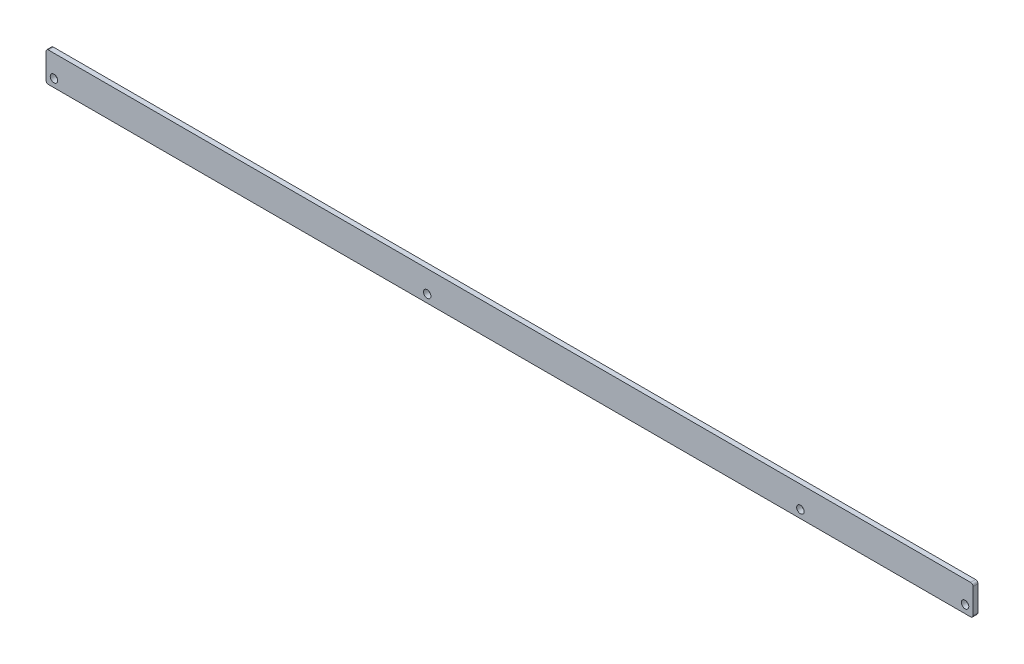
ISO-10303-21;
HEADER;
FILE_DESCRIPTION(('STEP AP214'),'2;1');
FILE_NAME('part.step','',(''),(''),'','','');
FILE_SCHEMA(('AUTOMOTIVE_DESIGN { 1 0 10303 214 1 1 1 1 }'));
ENDSEC;
DATA;
#1=APPLICATION_CONTEXT('core data for automotive mechanical design processes');
#2=APPLICATION_PROTOCOL_DEFINITION('international standard','automotive_design',2000,#1);
#3=PRODUCT_CONTEXT('',#1,'mechanical');
#4=PRODUCT('Part','Part','',(#3));
#5=PRODUCT_RELATED_PRODUCT_CATEGORY('part','',(#4));
#6=PRODUCT_DEFINITION_FORMATION('','',#4);
#7=PRODUCT_DEFINITION_CONTEXT('part definition',#1,'design');
#8=PRODUCT_DEFINITION('design','',#6,#7);
#9=PRODUCT_DEFINITION_SHAPE('','',#8);
#10=(LENGTH_UNIT() NAMED_UNIT(*) SI_UNIT(.MILLI.,.METRE.));
#11=(NAMED_UNIT(*) PLANE_ANGLE_UNIT() SI_UNIT($,.RADIAN.));
#12=(NAMED_UNIT(*) SI_UNIT($,.STERADIAN.) SOLID_ANGLE_UNIT());
#13=UNCERTAINTY_MEASURE_WITH_UNIT(LENGTH_MEASURE(1.E-05),#10,'distance_accuracy_value','');
#14=(GEOMETRIC_REPRESENTATION_CONTEXT(3) GLOBAL_UNCERTAINTY_ASSIGNED_CONTEXT((#13)) GLOBAL_UNIT_ASSIGNED_CONTEXT((#10,
#11,#12)) REPRESENTATION_CONTEXT('',''));
#15=CARTESIAN_POINT('',(0.,0.,0.));
#16=DIRECTION('',(0.,0.,1.));
#17=DIRECTION('',(1.,0.,0.));
#18=AXIS2_PLACEMENT_3D('',#15,#16,#17);
#19=CARTESIAN_POINT('',(-608.3862135,-198.501,3.175));
#20=DIRECTION('',(0.,0.,-1.));
#21=DIRECTION('',(-1.,0.,0.));
#22=AXIS2_PLACEMENT_3D('',#19,#20,#21);
#23=CYLINDRICAL_SURFACE('',#22,1.52399999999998);
#24=CARTESIAN_POINT('',(-608.3862135,-198.501,0.));
#25=DIRECTION('',(0.,0.,1.));
#26=DIRECTION('',(1.,0.,0.));
#27=AXIS2_PLACEMENT_3D('',#24,#25,#26);
#28=CIRCLE('',#27,1.52399999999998);
#29=CARTESIAN_POINT('',(-608.3862135,-200.025,0.));
#30=VERTEX_POINT('',#29);
#31=CARTESIAN_POINT('',(-606.8622135,-198.501,0.));
#32=VERTEX_POINT('',#31);
#33=EDGE_CURVE('E149',#30,#32,#28,.T.);
#34=ORIENTED_EDGE('',*,*,#33,.T.);
#35=DIRECTION('',(0.,0.,-1.));
#36=VECTOR('',#35,1.);
#37=CARTESIAN_POINT('',(-606.8622135,-198.501,3.175));
#38=LINE('',#37,#36);
#39=CARTESIAN_POINT('',(-606.8622135,-198.501,3.175));
#40=VERTEX_POINT('',#39);
#41=EDGE_CURVE('E11',#40,#32,#38,.T.);
#42=ORIENTED_EDGE('',*,*,#41,.F.);
#43=CARTESIAN_POINT('',(-608.3862135,-198.501,3.175));
#44=DIRECTION('',(0.,0.,1.));
#45=DIRECTION('',(1.,0.,0.));
#46=AXIS2_PLACEMENT_3D('',#43,#44,#45);
#47=CIRCLE('',#46,1.52399999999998);
#48=CARTESIAN_POINT('',(-608.3862135,-200.025,3.175));
#49=VERTEX_POINT('',#48);
#50=EDGE_CURVE('E172',#49,#40,#47,.T.);
#51=ORIENTED_EDGE('',*,*,#50,.F.);
#52=DIRECTION('',(0.,0.,-1.));
#53=VECTOR('',#52,1.);
#54=CARTESIAN_POINT('',(-608.3862135,-200.025,3.175));
#55=LINE('',#54,#53);
#56=EDGE_CURVE('E145',#49,#30,#55,.T.);
#57=ORIENTED_EDGE('',*,*,#56,.T.);
#58=EDGE_LOOP('',(#34,#42,#51,#57));
#59=FACE_BOUND('',#58,.T.);
#60=ADVANCED_FACE('F47',(#59),#23,.T.);
#61=CARTESIAN_POINT('',(-606.8622135,-198.501,3.175));
#62=DIRECTION('',(-1.,0.,0.));
#63=DIRECTION('',(0.,0.,1.));
#64=AXIS2_PLACEMENT_3D('',#61,#62,#63);
#65=PLANE('',#64);
#66=DIRECTION('',(0.,1.,0.));
#67=VECTOR('',#66,1.);
#68=CARTESIAN_POINT('',(-606.8622135,-198.501,0.));
#69=LINE('',#68,#67);
#70=CARTESIAN_POINT('',(-606.8622135,-182.499,0.));
#71=VERTEX_POINT('',#70);
#72=EDGE_CURVE('E153',#32,#71,#69,.T.);
#73=ORIENTED_EDGE('',*,*,#72,.T.);
#74=DIRECTION('',(0.,0.,-1.));
#75=VECTOR('',#74,1.);
#76=CARTESIAN_POINT('',(-606.8622135,-182.499,3.175));
#77=LINE('',#76,#75);
#78=CARTESIAN_POINT('',(-606.8622135,-182.499,3.175));
#79=VERTEX_POINT('',#78);
#80=EDGE_CURVE('E56',#79,#71,#77,.T.);
#81=ORIENTED_EDGE('',*,*,#80,.F.);
#82=DIRECTION('',(0.,1.,0.));
#83=VECTOR('',#82,1.);
#84=CARTESIAN_POINT('',(-606.8622135,-198.501,3.175));
#85=LINE('',#84,#83);
#86=EDGE_CURVE('E107',#40,#79,#85,.T.);
#87=ORIENTED_EDGE('',*,*,#86,.F.);
#88=ORIENTED_EDGE('',*,*,#41,.T.);
#89=EDGE_LOOP('',(#73,#81,#87,#88));
#90=FACE_BOUND('',#89,.T.);
#91=ADVANCED_FACE('F284',(#90),#65,.F.);
#92=CARTESIAN_POINT('',(-608.3862135,-182.499,3.175));
#93=DIRECTION('',(0.,0.,-1.));
#94=DIRECTION('',(-1.,0.,0.));
#95=AXIS2_PLACEMENT_3D('',#92,#93,#94);
#96=CYLINDRICAL_SURFACE('',#95,1.52399999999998);
#97=CARTESIAN_POINT('',(-608.3862135,-182.499,0.));
#98=DIRECTION('',(0.,0.,1.));
#99=DIRECTION('',(-1.,0.,0.));
#100=AXIS2_PLACEMENT_3D('',#97,#98,#99);
#101=CIRCLE('',#100,1.52399999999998);
#102=CARTESIAN_POINT('',(-608.3862135,-180.975,0.));
#103=VERTEX_POINT('',#102);
#104=EDGE_CURVE('E157',#71,#103,#101,.T.);
#105=ORIENTED_EDGE('',*,*,#104,.T.);
#106=DIRECTION('',(0.,0.,-1.));
#107=VECTOR('',#106,1.);
#108=CARTESIAN_POINT('',(-608.3862135,-180.975,3.175));
#109=LINE('',#108,#107);
#110=CARTESIAN_POINT('',(-608.3862135,-180.975,3.175));
#111=VERTEX_POINT('',#110);
#112=EDGE_CURVE('E183',#111,#103,#109,.T.);
#113=ORIENTED_EDGE('',*,*,#112,.F.);
#114=CARTESIAN_POINT('',(-608.3862135,-182.499,3.175));
#115=DIRECTION('',(0.,0.,1.));
#116=DIRECTION('',(-1.,0.,0.));
#117=AXIS2_PLACEMENT_3D('',#114,#115,#116);
#118=CIRCLE('',#117,1.52399999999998);
#119=EDGE_CURVE('E194',#79,#111,#118,.T.);
#120=ORIENTED_EDGE('',*,*,#119,.F.);
#121=ORIENTED_EDGE('',*,*,#80,.T.);
#122=EDGE_LOOP('',(#105,#113,#120,#121));
#123=FACE_BOUND('',#122,.T.);
#124=ADVANCED_FACE('F192',(#123),#96,.T.);
#125=CARTESIAN_POINT('',(-1195.8882135,-180.975,3.175));
#126=DIRECTION('',(0.,-1.,0.));
#127=DIRECTION('',(0.,0.,-1.));
#128=AXIS2_PLACEMENT_3D('',#125,#126,#127);
#129=PLANE('',#128);
#130=DIRECTION('',(-1.,0.,0.));
#131=VECTOR('',#130,1.);
#132=CARTESIAN_POINT('',(-1195.8882135,-180.975,0.));
#133=LINE('',#132,#131);
#134=CARTESIAN_POINT('',(-1195.8882135,-180.975,0.));
#135=VERTEX_POINT('',#134);
#136=EDGE_CURVE('E160',#103,#135,#133,.T.);
#137=ORIENTED_EDGE('',*,*,#136,.T.);
#138=DIRECTION('',(0.,0.,-1.));
#139=VECTOR('',#138,1.);
#140=CARTESIAN_POINT('',(-1195.8882135,-180.975,3.175));
#141=LINE('',#140,#139);
#142=CARTESIAN_POINT('',(-1195.8882135,-180.975,3.175));
#143=VERTEX_POINT('',#142);
#144=EDGE_CURVE('E179',#143,#135,#141,.T.);
#145=ORIENTED_EDGE('',*,*,#144,.F.);
#146=DIRECTION('',(-1.,0.,0.));
#147=VECTOR('',#146,1.);
#148=CARTESIAN_POINT('',(-1195.8882135,-180.975,3.175));
#149=LINE('',#148,#147);
#150=EDGE_CURVE('E207',#111,#143,#149,.T.);
#151=ORIENTED_EDGE('',*,*,#150,.F.);
#152=ORIENTED_EDGE('',*,*,#112,.T.);
#153=EDGE_LOOP('',(#137,#145,#151,#152));
#154=FACE_BOUND('',#153,.T.);
#155=ADVANCED_FACE('F202',(#154),#129,.F.);
#156=CARTESIAN_POINT('',(-1195.8882135,-182.499,3.175));
#157=DIRECTION('',(0.,0.,-1.));
#158=DIRECTION('',(-1.,0.,0.));
#159=AXIS2_PLACEMENT_3D('',#156,#157,#158);
#160=CYLINDRICAL_SURFACE('',#159,1.52400000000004);
#161=CARTESIAN_POINT('',(-1195.8882135,-182.499,0.));
#162=DIRECTION('',(0.,0.,1.));
#163=DIRECTION('',(-1.,0.,0.));
#164=AXIS2_PLACEMENT_3D('',#161,#162,#163);
#165=CIRCLE('',#164,1.52400000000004);
#166=CARTESIAN_POINT('',(-1197.4122135,-182.499,0.));
#167=VERTEX_POINT('',#166);
#168=EDGE_CURVE('E163',#135,#167,#165,.T.);
#169=ORIENTED_EDGE('',*,*,#168,.T.);
#170=DIRECTION('',(0.,0.,-1.));
#171=VECTOR('',#170,1.);
#172=CARTESIAN_POINT('',(-1197.4122135,-182.499,3.175));
#173=LINE('',#172,#171);
#174=CARTESIAN_POINT('',(-1197.4122135,-182.499,3.175));
#175=VERTEX_POINT('',#174);
#176=EDGE_CURVE('E137',#175,#167,#173,.T.);
#177=ORIENTED_EDGE('',*,*,#176,.F.);
#178=CARTESIAN_POINT('',(-1195.8882135,-182.499,3.175));
#179=DIRECTION('',(0.,0.,1.));
#180=DIRECTION('',(-1.,0.,0.));
#181=AXIS2_PLACEMENT_3D('',#178,#179,#180);
#182=CIRCLE('',#181,1.52400000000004);
#183=EDGE_CURVE('E126',#143,#175,#182,.T.);
#184=ORIENTED_EDGE('',*,*,#183,.F.);
#185=ORIENTED_EDGE('',*,*,#144,.T.);
#186=EDGE_LOOP('',(#169,#177,#184,#185));
#187=FACE_BOUND('',#186,.T.);
#188=ADVANCED_FACE('F205',(#187),#160,.T.);
#189=CARTESIAN_POINT('',(-1197.4122135,-198.501,3.175));
#190=DIRECTION('',(1.,0.,0.));
#191=DIRECTION('',(0.,0.,-1.));
#192=AXIS2_PLACEMENT_3D('',#189,#190,#191);
#193=PLANE('',#192);
#194=DIRECTION('',(0.,-1.,0.));
#195=VECTOR('',#194,1.);
#196=CARTESIAN_POINT('',(-1197.4122135,-198.501,0.));
#197=LINE('',#196,#195);
#198=CARTESIAN_POINT('',(-1197.4122135,-198.501,0.));
#199=VERTEX_POINT('',#198);
#200=EDGE_CURVE('E135',#167,#199,#197,.T.);
#201=ORIENTED_EDGE('',*,*,#200,.T.);
#202=DIRECTION('',(0.,0.,-1.));
#203=VECTOR('',#202,1.);
#204=CARTESIAN_POINT('',(-1197.4122135,-198.501,3.175));
#205=LINE('',#204,#203);
#206=CARTESIAN_POINT('',(-1197.4122135,-198.501,3.175));
#207=VERTEX_POINT('',#206);
#208=EDGE_CURVE('E132',#207,#199,#205,.T.);
#209=ORIENTED_EDGE('',*,*,#208,.F.);
#210=DIRECTION('',(0.,-1.,0.));
#211=VECTOR('',#210,1.);
#212=CARTESIAN_POINT('',(-1197.4122135,-198.501,3.175));
#213=LINE('',#212,#211);
#214=EDGE_CURVE('E120',#175,#207,#213,.T.);
#215=ORIENTED_EDGE('',*,*,#214,.F.);
#216=ORIENTED_EDGE('',*,*,#176,.T.);
#217=EDGE_LOOP('',(#201,#209,#215,#216));
#218=FACE_BOUND('',#217,.T.);
#219=ADVANCED_FACE('F133',(#218),#193,.F.);
#220=CARTESIAN_POINT('',(-1195.8882135,-198.501,3.175));
#221=DIRECTION('',(0.,0.,-1.));
#222=DIRECTION('',(-1.,0.,0.));
#223=AXIS2_PLACEMENT_3D('',#220,#221,#222);
#224=CYLINDRICAL_SURFACE('',#223,1.52400000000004);
#225=CARTESIAN_POINT('',(-1195.8882135,-198.501,0.));
#226=DIRECTION('',(0.,0.,1.));
#227=DIRECTION('',(-1.,0.,0.));
#228=AXIS2_PLACEMENT_3D('',#225,#226,#227);
#229=CIRCLE('',#228,1.52400000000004);
#230=CARTESIAN_POINT('',(-1195.8882135,-200.025,0.));
#231=VERTEX_POINT('',#230);
#232=EDGE_CURVE('E93',#199,#231,#229,.T.);
#233=ORIENTED_EDGE('',*,*,#232,.T.);
#234=DIRECTION('',(0.,0.,-1.));
#235=VECTOR('',#234,1.);
#236=CARTESIAN_POINT('',(-1195.8882135,-200.025,3.175));
#237=LINE('',#236,#235);
#238=CARTESIAN_POINT('',(-1195.8882135,-200.025,3.175));
#239=VERTEX_POINT('',#238);
#240=EDGE_CURVE('E138',#239,#231,#237,.T.);
#241=ORIENTED_EDGE('',*,*,#240,.F.);
#242=CARTESIAN_POINT('',(-1195.8882135,-198.501,3.175));
#243=DIRECTION('',(0.,0.,1.));
#244=DIRECTION('',(-1.,0.,0.));
#245=AXIS2_PLACEMENT_3D('',#242,#243,#244);
#246=CIRCLE('',#245,1.52400000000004);
#247=EDGE_CURVE('E124',#207,#239,#246,.T.);
#248=ORIENTED_EDGE('',*,*,#247,.F.);
#249=ORIENTED_EDGE('',*,*,#208,.T.);
#250=EDGE_LOOP('',(#233,#241,#248,#249));
#251=FACE_BOUND('',#250,.T.);
#252=ADVANCED_FACE('F140',(#251),#224,.T.);
#253=CARTESIAN_POINT('',(-1195.8882135,-200.025,3.175));
#254=DIRECTION('',(0.,1.,0.));
#255=DIRECTION('',(0.,0.,1.));
#256=AXIS2_PLACEMENT_3D('',#253,#254,#255);
#257=PLANE('',#256);
#258=DIRECTION('',(1.,0.,0.));
#259=VECTOR('',#258,1.);
#260=CARTESIAN_POINT('',(-1195.8882135,-200.025,0.));
#261=LINE('',#260,#259);
#262=EDGE_CURVE('E99',#231,#30,#261,.T.);
#263=ORIENTED_EDGE('',*,*,#262,.T.);
#264=ORIENTED_EDGE('',*,*,#56,.F.);
#265=DIRECTION('',(1.,0.,0.));
#266=VECTOR('',#265,1.);
#267=CARTESIAN_POINT('',(-1195.8882135,-200.025,3.175));
#268=LINE('',#267,#266);
#269=EDGE_CURVE('E64',#239,#49,#268,.T.);
#270=ORIENTED_EDGE('',*,*,#269,.F.);
#271=ORIENTED_EDGE('',*,*,#240,.T.);
#272=EDGE_LOOP('',(#263,#264,#270,#271));
#273=FACE_BOUND('',#272,.T.);
#274=ADVANCED_FACE('F262',(#273),#257,.F.);
#275=CARTESIAN_POINT('',(-608.3862135,-198.501,3.175));
#276=DIRECTION('',(0.,0.,1.));
#277=DIRECTION('',(1.,0.,0.));
#278=AXIS2_PLACEMENT_3D('',#275,#276,#277);
#279=PLANE('',#278);
#280=CARTESIAN_POINT('',(-1192.3322135,-194.945,3.175));
#281=DIRECTION('',(0.,0.,1.));
#282=DIRECTION('',(1.,0.,0.));
#283=AXIS2_PLACEMENT_3D('',#280,#281,#282);
#284=CIRCLE('',#283,2.38125);
#285=CARTESIAN_POINT('',(-1189.9509635,-194.945,3.175));
#286=VERTEX_POINT('',#285);
#287=EDGE_CURVE('E241',#286,#286,#284,.T.);
#288=ORIENTED_EDGE('',*,*,#287,.F.);
#289=EDGE_LOOP('',(#288));
#290=FACE_BOUND('',#289,.T.);
#291=CARTESIAN_POINT('',(-611.9422135,-194.945,3.175));
#292=DIRECTION('',(0.,0.,1.));
#293=DIRECTION('',(1.,0.,0.));
#294=AXIS2_PLACEMENT_3D('',#291,#292,#293);
#295=CIRCLE('',#294,2.38125);
#296=CARTESIAN_POINT('',(-609.5609635,-194.945,3.175));
#297=VERTEX_POINT('',#296);
#298=EDGE_CURVE('E233',#297,#297,#295,.T.);
#299=ORIENTED_EDGE('',*,*,#298,.F.);
#300=EDGE_LOOP('',(#299));
#301=FACE_BOUND('',#300,.T.);
#302=CARTESIAN_POINT('',(-716.83,-194.945,3.175));
#303=DIRECTION('',(0.,0.,1.));
#304=DIRECTION('',(1.,0.,0.));
#305=AXIS2_PLACEMENT_3D('',#302,#303,#304);
#306=CIRCLE('',#305,2.38125);
#307=CARTESIAN_POINT('',(-714.44875,-194.945,3.175));
#308=VERTEX_POINT('',#307);
#309=EDGE_CURVE('E225',#308,#308,#306,.T.);
#310=ORIENTED_EDGE('',*,*,#309,.F.);
#311=EDGE_LOOP('',(#310));
#312=FACE_BOUND('',#311,.T.);
#313=CARTESIAN_POINT('',(-954.58110675,-194.945,3.175));
#314=DIRECTION('',(0.,0.,1.));
#315=DIRECTION('',(1.,0.,0.));
#316=AXIS2_PLACEMENT_3D('',#313,#314,#315);
#317=CIRCLE('',#316,2.38125);
#318=CARTESIAN_POINT('',(-952.19985675,-194.945,3.175));
#319=VERTEX_POINT('',#318);
#320=EDGE_CURVE('E154',#319,#319,#317,.T.);
#321=ORIENTED_EDGE('',*,*,#320,.F.);
#322=EDGE_LOOP('',(#321));
#323=FACE_BOUND('',#322,.T.);
#324=ORIENTED_EDGE('',*,*,#50,.T.);
#325=ORIENTED_EDGE('',*,*,#86,.T.);
#326=ORIENTED_EDGE('',*,*,#119,.T.);
#327=ORIENTED_EDGE('',*,*,#150,.T.);
#328=ORIENTED_EDGE('',*,*,#183,.T.);
#329=ORIENTED_EDGE('',*,*,#214,.T.);
#330=ORIENTED_EDGE('',*,*,#247,.T.);
#331=ORIENTED_EDGE('',*,*,#269,.T.);
#332=EDGE_LOOP('',(#324,#325,#326,#327,#328,#329,#330,#331));
#333=FACE_BOUND('',#332,.T.);
#334=ADVANCED_FACE('F122',(#290,#301,#312,#323,#333),#279,.T.);
#335=CARTESIAN_POINT('',(-608.3862135,-198.501,0.));
#336=DIRECTION('',(0.,0.,1.));
#337=DIRECTION('',(1.,0.,0.));
#338=AXIS2_PLACEMENT_3D('',#335,#336,#337);
#339=PLANE('',#338);
#340=CARTESIAN_POINT('',(-1192.3322135,-194.945,0.));
#341=DIRECTION('',(0.,0.,1.));
#342=DIRECTION('',(1.,0.,0.));
#343=AXIS2_PLACEMENT_3D('',#340,#341,#342);
#344=CIRCLE('',#343,2.38125);
#345=CARTESIAN_POINT('',(-1189.9509635,-194.945,0.));
#346=VERTEX_POINT('',#345);
#347=EDGE_CURVE('E245',#346,#346,#344,.T.);
#348=ORIENTED_EDGE('',*,*,#347,.T.);
#349=EDGE_LOOP('',(#348));
#350=FACE_BOUND('',#349,.T.);
#351=CARTESIAN_POINT('',(-611.9422135,-194.945,0.));
#352=DIRECTION('',(0.,0.,1.));
#353=DIRECTION('',(1.,0.,0.));
#354=AXIS2_PLACEMENT_3D('',#351,#352,#353);
#355=CIRCLE('',#354,2.38125);
#356=CARTESIAN_POINT('',(-609.5609635,-194.945,0.));
#357=VERTEX_POINT('',#356);
#358=EDGE_CURVE('E237',#357,#357,#355,.T.);
#359=ORIENTED_EDGE('',*,*,#358,.T.);
#360=EDGE_LOOP('',(#359));
#361=FACE_BOUND('',#360,.T.);
#362=CARTESIAN_POINT('',(-716.83,-194.945,0.));
#363=DIRECTION('',(0.,0.,1.));
#364=DIRECTION('',(1.,0.,0.));
#365=AXIS2_PLACEMENT_3D('',#362,#363,#364);
#366=CIRCLE('',#365,2.38125);
#367=CARTESIAN_POINT('',(-714.44875,-194.945,0.));
#368=VERTEX_POINT('',#367);
#369=EDGE_CURVE('E229',#368,#368,#366,.T.);
#370=ORIENTED_EDGE('',*,*,#369,.T.);
#371=EDGE_LOOP('',(#370));
#372=FACE_BOUND('',#371,.T.);
#373=CARTESIAN_POINT('',(-954.58110675,-194.945,0.));
#374=DIRECTION('',(0.,0.,1.));
#375=DIRECTION('',(1.,0.,0.));
#376=AXIS2_PLACEMENT_3D('',#373,#374,#375);
#377=CIRCLE('',#376,2.38125);
#378=CARTESIAN_POINT('',(-952.19985675,-194.945,0.));
#379=VERTEX_POINT('',#378);
#380=EDGE_CURVE('E221',#379,#379,#377,.T.);
#381=ORIENTED_EDGE('',*,*,#380,.T.);
#382=EDGE_LOOP('',(#381));
#383=FACE_BOUND('',#382,.T.);
#384=ORIENTED_EDGE('',*,*,#33,.F.);
#385=ORIENTED_EDGE('',*,*,#262,.F.);
#386=ORIENTED_EDGE('',*,*,#232,.F.);
#387=ORIENTED_EDGE('',*,*,#200,.F.);
#388=ORIENTED_EDGE('',*,*,#168,.F.);
#389=ORIENTED_EDGE('',*,*,#136,.F.);
#390=ORIENTED_EDGE('',*,*,#104,.F.);
#391=ORIENTED_EDGE('',*,*,#72,.F.);
#392=EDGE_LOOP('',(#384,#385,#386,#387,#388,#389,#390,#391));
#393=FACE_BOUND('',#392,.T.);
#394=ADVANCED_FACE('F198',(#350,#361,#372,#383,#393),#339,.F.);
#395=CARTESIAN_POINT('',(-954.58110675,-194.945,3.175));
#396=DIRECTION('',(0.,0.,1.));
#397=DIRECTION('',(1.,0.,0.));
#398=AXIS2_PLACEMENT_3D('',#395,#396,#397);
#399=CYLINDRICAL_SURFACE('',#398,2.38125);
#400=ORIENTED_EDGE('',*,*,#380,.F.);
#401=EDGE_LOOP('',(#400));
#402=FACE_BOUND('',#401,.T.);
#403=ORIENTED_EDGE('',*,*,#320,.T.);
#404=EDGE_LOOP('',(#403));
#405=FACE_BOUND('',#404,.T.);
#406=ADVANCED_FACE('F270',(#402,#405),#399,.F.);
#407=CARTESIAN_POINT('',(-716.83,-194.945,3.175));
#408=DIRECTION('',(0.,0.,1.));
#409=DIRECTION('',(1.,0.,0.));
#410=AXIS2_PLACEMENT_3D('',#407,#408,#409);
#411=CYLINDRICAL_SURFACE('',#410,2.38125);
#412=ORIENTED_EDGE('',*,*,#369,.F.);
#413=EDGE_LOOP('',(#412));
#414=FACE_BOUND('',#413,.T.);
#415=ORIENTED_EDGE('',*,*,#309,.T.);
#416=EDGE_LOOP('',(#415));
#417=FACE_BOUND('',#416,.T.);
#418=ADVANCED_FACE('F272',(#414,#417),#411,.F.);
#419=CARTESIAN_POINT('',(-611.9422135,-194.945,3.175));
#420=DIRECTION('',(0.,0.,1.));
#421=DIRECTION('',(1.,0.,0.));
#422=AXIS2_PLACEMENT_3D('',#419,#420,#421);
#423=CYLINDRICAL_SURFACE('',#422,2.38125);
#424=ORIENTED_EDGE('',*,*,#358,.F.);
#425=EDGE_LOOP('',(#424));
#426=FACE_BOUND('',#425,.T.);
#427=ORIENTED_EDGE('',*,*,#298,.T.);
#428=EDGE_LOOP('',(#427));
#429=FACE_BOUND('',#428,.T.);
#430=ADVANCED_FACE('F256',(#426,#429),#423,.F.);
#431=CARTESIAN_POINT('',(-1192.3322135,-194.945,3.175));
#432=DIRECTION('',(0.,0.,1.));
#433=DIRECTION('',(1.,0.,0.));
#434=AXIS2_PLACEMENT_3D('',#431,#432,#433);
#435=CYLINDRICAL_SURFACE('',#434,2.38125);
#436=ORIENTED_EDGE('',*,*,#347,.F.);
#437=EDGE_LOOP('',(#436));
#438=FACE_BOUND('',#437,.T.);
#439=ORIENTED_EDGE('',*,*,#287,.T.);
#440=EDGE_LOOP('',(#439));
#441=FACE_BOUND('',#440,.T.);
#442=ADVANCED_FACE('F253',(#438,#441),#435,.F.);
#443=CLOSED_SHELL('',(#60,#91,#124,#155,#188,#219,#252,#274,#334,#394,#406,#418,#430,#442));
#444=MANIFOLD_SOLID_BREP('B2',#443);
#445=ADVANCED_BREP_SHAPE_REPRESENTATION('',(#18,#444),#14);
#446=SHAPE_DEFINITION_REPRESENTATION(#9,#445);
ENDSEC;
END-ISO-10303-21;
